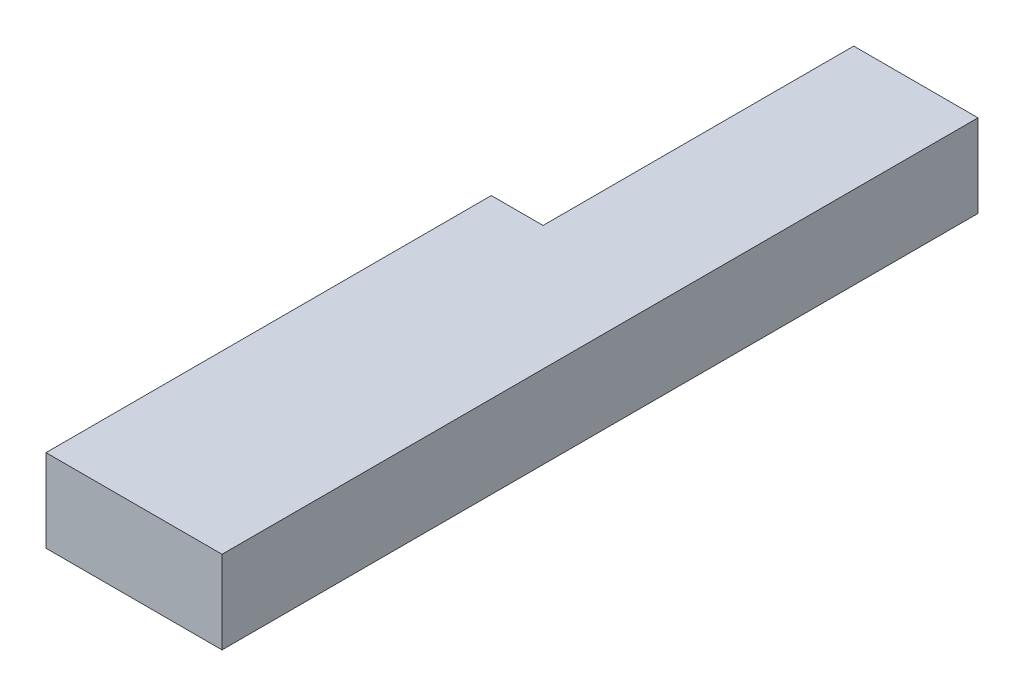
ISO-10303-21;
HEADER;
FILE_DESCRIPTION(('STEP AP214'),'2;1');
FILE_NAME('part.step','',(''),(''),'','','');
FILE_SCHEMA(('AUTOMOTIVE_DESIGN { 1 0 10303 214 1 1 1 1 }'));
ENDSEC;
DATA;
#1=APPLICATION_CONTEXT('core data for automotive mechanical design processes');
#2=APPLICATION_PROTOCOL_DEFINITION('international standard','automotive_design',2000,#1);
#3=PRODUCT_CONTEXT('',#1,'mechanical');
#4=PRODUCT('Part','Part','',(#3));
#5=PRODUCT_RELATED_PRODUCT_CATEGORY('part','',(#4));
#6=PRODUCT_DEFINITION_FORMATION('','',#4);
#7=PRODUCT_DEFINITION_CONTEXT('part definition',#1,'design');
#8=PRODUCT_DEFINITION('design','',#6,#7);
#9=PRODUCT_DEFINITION_SHAPE('','',#8);
#10=(LENGTH_UNIT() NAMED_UNIT(*) SI_UNIT(.MILLI.,.METRE.));
#11=(NAMED_UNIT(*) PLANE_ANGLE_UNIT() SI_UNIT($,.RADIAN.));
#12=(NAMED_UNIT(*) SI_UNIT($,.STERADIAN.) SOLID_ANGLE_UNIT());
#13=UNCERTAINTY_MEASURE_WITH_UNIT(LENGTH_MEASURE(1.E-05),#10,'distance_accuracy_value','');
#14=(GEOMETRIC_REPRESENTATION_CONTEXT(3) GLOBAL_UNCERTAINTY_ASSIGNED_CONTEXT((#13)) GLOBAL_UNIT_ASSIGNED_CONTEXT((#10,
#11,#12)) REPRESENTATION_CONTEXT('',''));
#15=CARTESIAN_POINT('',(0.,0.,0.));
#16=DIRECTION('',(0.,0.,1.));
#17=DIRECTION('',(1.,0.,0.));
#18=AXIS2_PLACEMENT_3D('',#15,#16,#17);
#19=CARTESIAN_POINT('',(13.36,1.9,-3.));
#20=DIRECTION('',(0.,0.,1.));
#21=DIRECTION('',(1.,0.,0.));
#22=AXIS2_PLACEMENT_3D('',#19,#20,#21);
#23=PLANE('',#22);
#24=DIRECTION('',(0.,1.,0.));
#25=VECTOR('',#24,1.);
#26=CARTESIAN_POINT('',(14.560000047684,1.9,-3.));
#27=LINE('',#26,#25);
#28=CARTESIAN_POINT('',(14.560000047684,1.9,-3.));
#29=VERTEX_POINT('',#28);
#30=CARTESIAN_POINT('',(14.560000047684,2.700000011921,-3.));
#31=VERTEX_POINT('',#30);
#32=EDGE_CURVE('E69',#29,#31,#27,.T.);
#33=ORIENTED_EDGE('',*,*,#32,.F.);
#34=DIRECTION('',(1.,0.,0.));
#35=VECTOR('',#34,1.);
#36=CARTESIAN_POINT('',(13.36,1.9,-3.));
#37=LINE('',#36,#35);
#38=CARTESIAN_POINT('',(13.36,1.9,-3.));
#39=VERTEX_POINT('',#38);
#40=EDGE_CURVE('E20',#39,#29,#37,.T.);
#41=ORIENTED_EDGE('',*,*,#40,.F.);
#42=DIRECTION('',(0.,1.,0.));
#43=VECTOR('',#42,1.);
#44=CARTESIAN_POINT('',(13.36,1.9,-3.));
#45=LINE('',#44,#43);
#46=CARTESIAN_POINT('',(13.36,2.700000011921,-3.));
#47=VERTEX_POINT('',#46);
#48=EDGE_CURVE('E89',#39,#47,#45,.T.);
#49=ORIENTED_EDGE('',*,*,#48,.T.);
#50=DIRECTION('',(1.,0.,0.));
#51=VECTOR('',#50,1.);
#52=CARTESIAN_POINT('',(13.36,2.700000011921,-3.));
#53=LINE('',#52,#51);
#54=EDGE_CURVE('E78',#31,#47,#53,.F.);
#55=ORIENTED_EDGE('',*,*,#54,.F.);
#56=EDGE_LOOP('',(#33,#41,#49,#55));
#57=FACE_BOUND('',#56,.T.);
#58=ADVANCED_FACE('F17',(#57),#23,.F.);
#59=CARTESIAN_POINT('',(13.36,1.9,-3.));
#60=DIRECTION('',(1.,0.,0.));
#61=DIRECTION('',(0.,0.,-1.));
#62=AXIS2_PLACEMENT_3D('',#59,#60,#61);
#63=PLANE('',#62);
#64=DIRECTION('',(0.,0.,-1.));
#65=VECTOR('',#64,1.);
#66=CARTESIAN_POINT('',(13.36,2.700000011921,-3.));
#67=LINE('',#66,#65);
#68=CARTESIAN_POINT('',(13.36,2.700000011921,0.));
#69=VERTEX_POINT('',#68);
#70=EDGE_CURVE('E91',#47,#69,#67,.F.);
#71=ORIENTED_EDGE('',*,*,#70,.F.);
#72=ORIENTED_EDGE('',*,*,#48,.F.);
#73=DIRECTION('',(0.,0.,-1.));
#74=VECTOR('',#73,1.);
#75=CARTESIAN_POINT('',(13.36,1.9,-3.));
#76=LINE('',#75,#74);
#77=CARTESIAN_POINT('',(13.36,1.9,0.));
#78=VERTEX_POINT('',#77);
#79=EDGE_CURVE('E82',#78,#39,#76,.T.);
#80=ORIENTED_EDGE('',*,*,#79,.F.);
#81=DIRECTION('',(0.,1.,0.));
#82=VECTOR('',#81,1.);
#83=CARTESIAN_POINT('',(13.36,1.9,0.));
#84=LINE('',#83,#82);
#85=EDGE_CURVE('E99',#78,#69,#84,.T.);
#86=ORIENTED_EDGE('',*,*,#85,.T.);
#87=EDGE_LOOP('',(#71,#72,#80,#86));
#88=FACE_BOUND('',#87,.T.);
#89=ADVANCED_FACE('F126',(#88),#63,.F.);
#90=CARTESIAN_POINT('',(12.86,2.700000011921,0.));
#91=DIRECTION('',(0.,1.,0.));
#92=DIRECTION('',(0.,0.,1.));
#93=AXIS2_PLACEMENT_3D('',#90,#91,#92);
#94=PLANE('',#93);
#95=DIRECTION('',(0.,0.,-1.));
#96=VECTOR('',#95,1.);
#97=CARTESIAN_POINT('',(14.560000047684,2.700000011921,0.));
#98=LINE('',#97,#96);
#99=CARTESIAN_POINT('',(14.560000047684,2.700000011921,4.300000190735));
#100=VERTEX_POINT('',#99);
#101=EDGE_CURVE('E65',#31,#100,#98,.F.);
#102=ORIENTED_EDGE('',*,*,#101,.F.);
#103=ORIENTED_EDGE('',*,*,#54,.T.);
#104=ORIENTED_EDGE('',*,*,#70,.T.);
#105=DIRECTION('',(1.,0.,0.));
#106=VECTOR('',#105,1.);
#107=CARTESIAN_POINT('',(12.86,2.700000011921,0.));
#108=LINE('',#107,#106);
#109=CARTESIAN_POINT('',(12.86,2.700000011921,0.));
#110=VERTEX_POINT('',#109);
#111=EDGE_CURVE('E97',#69,#110,#108,.F.);
#112=ORIENTED_EDGE('',*,*,#111,.T.);
#113=DIRECTION('',(0.,0.,-1.));
#114=VECTOR('',#113,1.);
#115=CARTESIAN_POINT('',(12.86,2.700000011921,0.));
#116=LINE('',#115,#114);
#117=CARTESIAN_POINT('',(12.86,2.700000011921,4.300000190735));
#118=VERTEX_POINT('',#117);
#119=EDGE_CURVE('E104',#110,#118,#116,.F.);
#120=ORIENTED_EDGE('',*,*,#119,.T.);
#121=DIRECTION('',(1.,0.,0.));
#122=VECTOR('',#121,1.);
#123=CARTESIAN_POINT('',(12.86,2.700000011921,4.300000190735));
#124=LINE('',#123,#122);
#125=EDGE_CURVE('E108',#100,#118,#124,.F.);
#126=ORIENTED_EDGE('',*,*,#125,.F.);
#127=EDGE_LOOP('',(#102,#103,#104,#112,#120,#126));
#128=FACE_BOUND('',#127,.T.);
#129=ADVANCED_FACE('F127',(#128),#94,.T.);
#130=CARTESIAN_POINT('',(12.86,1.9,0.));
#131=DIRECTION('',(0.,0.,1.));
#132=DIRECTION('',(1.,0.,0.));
#133=AXIS2_PLACEMENT_3D('',#130,#131,#132);
#134=PLANE('',#133);
#135=DIRECTION('',(1.,0.,0.));
#136=VECTOR('',#135,1.);
#137=CARTESIAN_POINT('',(12.86,1.9,0.));
#138=LINE('',#137,#136);
#139=CARTESIAN_POINT('',(12.86,1.9,0.));
#140=VERTEX_POINT('',#139);
#141=EDGE_CURVE('E85',#78,#140,#138,.F.);
#142=ORIENTED_EDGE('',*,*,#141,.T.);
#143=DIRECTION('',(0.,1.,0.));
#144=VECTOR('',#143,1.);
#145=CARTESIAN_POINT('',(12.86,1.9,0.));
#146=LINE('',#145,#144);
#147=EDGE_CURVE('E101',#140,#110,#146,.T.);
#148=ORIENTED_EDGE('',*,*,#147,.T.);
#149=ORIENTED_EDGE('',*,*,#111,.F.);
#150=ORIENTED_EDGE('',*,*,#85,.F.);
#151=EDGE_LOOP('',(#142,#148,#149,#150));
#152=FACE_BOUND('',#151,.T.);
#153=ADVANCED_FACE('F124',(#152),#134,.F.);
#154=CARTESIAN_POINT('',(12.86,1.9,0.));
#155=DIRECTION('',(1.,0.,0.));
#156=DIRECTION('',(0.,0.,-1.));
#157=AXIS2_PLACEMENT_3D('',#154,#155,#156);
#158=PLANE('',#157);
#159=ORIENTED_EDGE('',*,*,#119,.F.);
#160=ORIENTED_EDGE('',*,*,#147,.F.);
#161=DIRECTION('',(0.,0.,1.));
#162=VECTOR('',#161,1.);
#163=CARTESIAN_POINT('',(12.86,1.9,0.));
#164=LINE('',#163,#162);
#165=CARTESIAN_POINT('',(12.86,1.9,4.300000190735));
#166=VERTEX_POINT('',#165);
#167=EDGE_CURVE('E114',#140,#166,#164,.T.);
#168=ORIENTED_EDGE('',*,*,#167,.T.);
#169=DIRECTION('',(0.,1.,0.));
#170=VECTOR('',#169,1.);
#171=CARTESIAN_POINT('',(12.86,1.9,4.300000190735));
#172=LINE('',#171,#170);
#173=EDGE_CURVE('E106',#118,#166,#172,.F.);
#174=ORIENTED_EDGE('',*,*,#173,.F.);
#175=EDGE_LOOP('',(#159,#160,#168,#174));
#176=FACE_BOUND('',#175,.T.);
#177=ADVANCED_FACE('F122',(#176),#158,.F.);
#178=CARTESIAN_POINT('',(12.86,1.9,4.300000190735));
#179=DIRECTION('',(0.,0.,1.));
#180=DIRECTION('',(1.,0.,0.));
#181=AXIS2_PLACEMENT_3D('',#178,#179,#180);
#182=PLANE('',#181);
#183=DIRECTION('',(0.,1.,0.));
#184=VECTOR('',#183,1.);
#185=CARTESIAN_POINT('',(14.560000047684,1.9,4.300000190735));
#186=LINE('',#185,#184);
#187=CARTESIAN_POINT('',(14.560000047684,1.9,4.300000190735));
#188=VERTEX_POINT('',#187);
#189=EDGE_CURVE('E34',#100,#188,#186,.F.);
#190=ORIENTED_EDGE('',*,*,#189,.F.);
#191=ORIENTED_EDGE('',*,*,#125,.T.);
#192=ORIENTED_EDGE('',*,*,#173,.T.);
#193=DIRECTION('',(1.,0.,0.));
#194=VECTOR('',#193,1.);
#195=CARTESIAN_POINT('',(12.86,1.9,4.300000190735));
#196=LINE('',#195,#194);
#197=EDGE_CURVE('E26',#166,#188,#196,.T.);
#198=ORIENTED_EDGE('',*,*,#197,.T.);
#199=EDGE_LOOP('',(#190,#191,#192,#198));
#200=FACE_BOUND('',#199,.T.);
#201=ADVANCED_FACE('F118',(#200),#182,.T.);
#202=CARTESIAN_POINT('',(14.560000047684,1.9,0.));
#203=DIRECTION('',(1.,0.,0.));
#204=DIRECTION('',(0.,0.,-1.));
#205=AXIS2_PLACEMENT_3D('',#202,#203,#204);
#206=PLANE('',#205);
#207=ORIENTED_EDGE('',*,*,#101,.T.);
#208=ORIENTED_EDGE('',*,*,#189,.T.);
#209=DIRECTION('',(0.,0.,1.));
#210=VECTOR('',#209,1.);
#211=CARTESIAN_POINT('',(14.560000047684,1.9,0.));
#212=LINE('',#211,#210);
#213=EDGE_CURVE('E11',#188,#29,#212,.F.);
#214=ORIENTED_EDGE('',*,*,#213,.T.);
#215=ORIENTED_EDGE('',*,*,#32,.T.);
#216=EDGE_LOOP('',(#207,#208,#214,#215));
#217=FACE_BOUND('',#216,.T.);
#218=ADVANCED_FACE('F68',(#217),#206,.T.);
#219=CARTESIAN_POINT('',(12.86,1.9,0.));
#220=DIRECTION('',(0.,1.,0.));
#221=DIRECTION('',(0.,0.,1.));
#222=AXIS2_PLACEMENT_3D('',#219,#220,#221);
#223=PLANE('',#222);
#224=ORIENTED_EDGE('',*,*,#213,.F.);
#225=ORIENTED_EDGE('',*,*,#197,.F.);
#226=ORIENTED_EDGE('',*,*,#167,.F.);
#227=ORIENTED_EDGE('',*,*,#141,.F.);
#228=ORIENTED_EDGE('',*,*,#79,.T.);
#229=ORIENTED_EDGE('',*,*,#40,.T.);
#230=EDGE_LOOP('',(#224,#225,#226,#227,#228,#229));
#231=FACE_BOUND('',#230,.T.);
#232=ADVANCED_FACE('F80',(#231),#223,.F.);
#233=CLOSED_SHELL('',(#58,#89,#129,#153,#177,#201,#218,#232));
#234=MANIFOLD_SOLID_BREP('B1',#233);
#235=ADVANCED_BREP_SHAPE_REPRESENTATION('',(#18,#234),#14);
#236=SHAPE_DEFINITION_REPRESENTATION(#9,#235);
ENDSEC;
END-ISO-10303-21;
